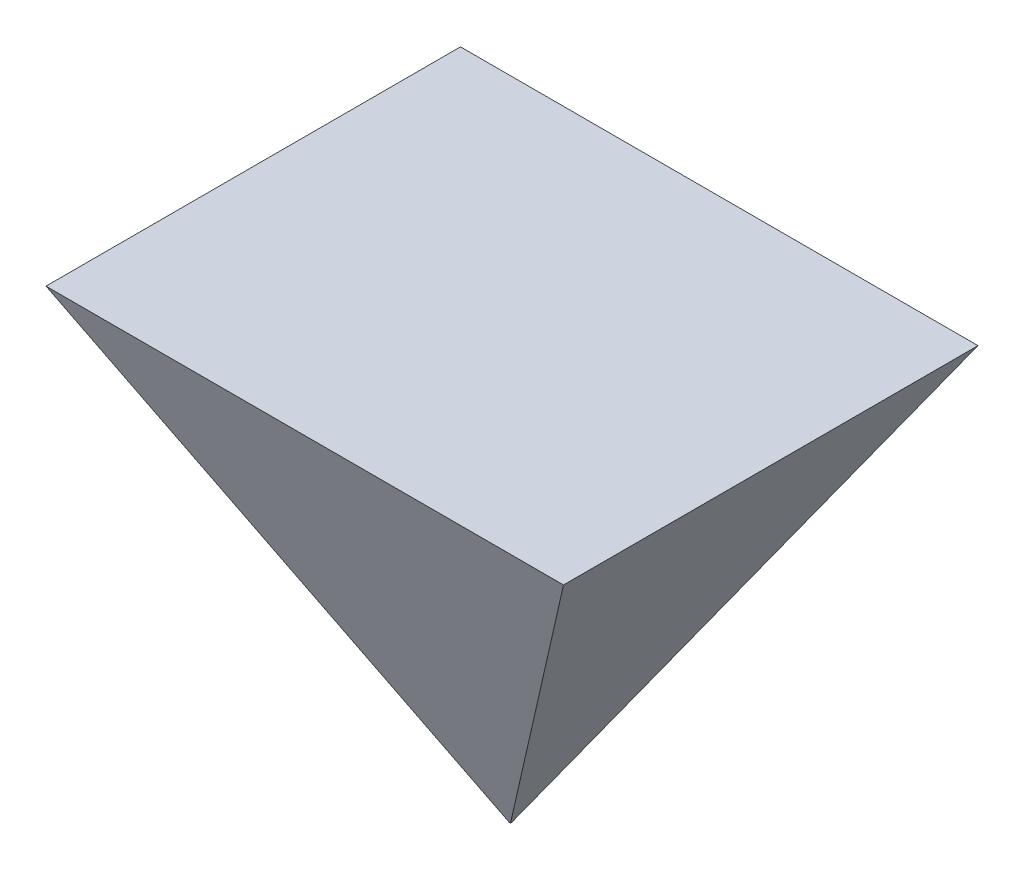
from build123d import *


with BuildPart() as part:
    # Sketch1 → Loft7 section 0
    with BuildSketch(Plane(origin=(0, 0, 0), x_dir=(1, 0, 0), z_dir=(0, 1, 0))):
        with BuildLine():
            Line((-6.477, 5.3086), (6.477, 5.3086))
            Line((6.477, 5.3086), (6.477, -5.334))
            Line((6.477, -5.334), (-6.477, -5.334))
            Line((-6.477, -5.334), (-6.477, 5.3086))
        make_face()
    # Sketch5 → Loft7 section 1
    with BuildSketch(Plane(origin=(0, 4978.4, 0), x_dir=(-1, 0, 0), z_dir=(0, 1, 0))):
        with BuildLine():
            Line((-2946.4, 2344.42), (2921, 2344.42))
            Line((2921, 2344.42), (2921, -2354.58))
            Line((2921, -2354.58), (-2946.4, -2354.58))
            Line((-2946.4, -2354.58), (-2946.4, 2344.42))
        make_face()
    loft()


solid = part.part
